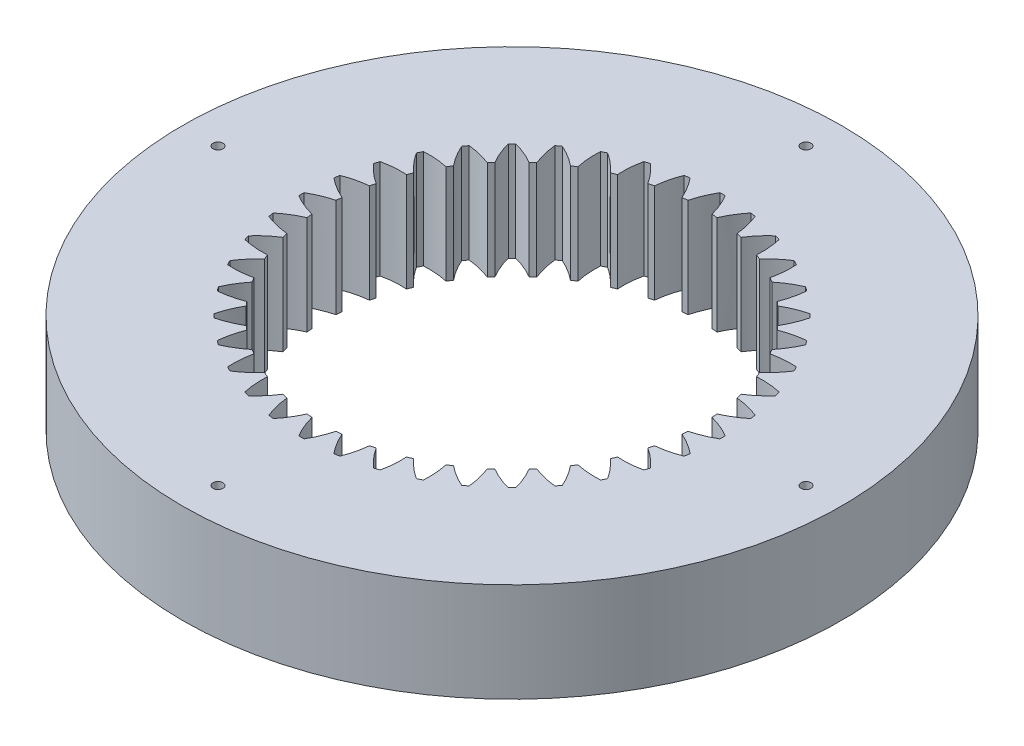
from build123d import *

# Parameters (mm, degrees)
SKETCH1_R           = 99.75
BOSS_EXTRUDE1_DEPTH = 30
SKETCH3_R           = 1.5
CUT_EXTRUDE1_DEPTH  = 145.222484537


with BuildPart() as part:
    # Sketch1 → Boss-Extrude1 (new body)
    with BuildSketch(Plane(origin=(0, 0, 0), x_dir=(1, 0, 0), z_dir=(0, 1, 0))):
        with Locations(Location((0, 0, 0), (0, 0, 270))):
            Circle(SKETCH1_R)
        with BuildLine():
            ThreePointArc((-3.646318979, 56.883251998), (-4.472168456, 56.824288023), (-5.297074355, 56.753334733))
            add(Edge.make_bspline(
                [(-5.297074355, 56.753334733), (-6.819032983, 60.229344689), (-9.181551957, 63.086362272)],
                knots=[0, 0, 0, 0.831880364, 0.831880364, 0.831880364], degree=2))
            ThreePointArc((-9.181551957, 63.086362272), (-9.972853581, 62.966119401), (-10.762583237, 62.835951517))
            add(Edge.make_bspline(
                [(-12.499927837, 55.612514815), (-12.126605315, 59.388707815), (-10.762583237, 62.835951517)],
                knots=[0, 0, 0, 0.831880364, 0.831880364, 0.831880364], degree=2))
            ThreePointArc((-12.499927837, 55.612514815), (-13.30638574, 55.425085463), (-14.110036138, 55.225962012))
            add(Edge.make_bspline(
                [(-14.110036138, 55.225962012), (-16.157024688, 58.421089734), (-18.93739315, 60.873353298)],
                knots=[0, 0, 0, 0.831880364, 0.831880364, 0.831880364], degree=2))
            ThreePointArc((-18.93739315, 60.873353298), (-19.700142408, 60.63080397), (-20.459786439, 60.378697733))
            add(Edge.make_bspline(
                [(-21.045746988, 52.97241295), (-21.267747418, 56.760515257), (-20.459786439, 60.378697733)],
                knots=[0, 0, 0, 0.831880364, 0.831880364, 0.831880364], degree=2))
            ThreePointArc((-21.045746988, 52.97241295), (-21.812955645, 52.661133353), (-22.575562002, 52.338742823))
            add(Edge.make_bspline(
                [(-22.575562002, 52.338742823), (-25.097176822, 55.174313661), (-28.226932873, 57.161440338)],
                knots=[0, 0, 0, 0.831880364, 0.831880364, 0.831880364], degree=2))
            ThreePointArc((-28.226932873, 57.161440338), (-28.942348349, 56.802556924), (-29.653201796, 56.434720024))
            add(Edge.make_bspline(
                [(-29.073350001, 49.027954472), (-29.885206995, 52.734690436), (-29.653201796, 56.434720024)],
                knots=[0, 0, 0, 0.831880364, 0.831880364, 0.831880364], degree=2))
            ThreePointArc((-29.073350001, 49.027954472), (-29.782418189, 48.600489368), (-30.485202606, 48.162770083))
            add(Edge.make_bspline(
                [(-30.485202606, 48.162770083), (-33.419353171, 50.568962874), (-36.82143183, 52.04202301)],
                knots=[0, 0, 0, 0.831880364, 0.831880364, 0.831880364], degree=2))
            ThreePointArc((-36.82143183, 52.04202301), (-37.471897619, 51.575642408), (-38.116456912, 51.101132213))
            add(Edge.make_bspline(
                [(-36.385070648, 43.876265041), (-37.766793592, 47.410362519), (-38.116456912, 51.101132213)],
                knots=[0, 0, 0, 0.831880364, 0.831880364, 0.831880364], degree=2))
            ThreePointArc((-36.385070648, 43.876265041), (-37.018538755, 43.343140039), (-37.644196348, 42.8008701))
            add(Edge.make_bspline(
                [(-37.644196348, 42.8008701), (-40.918634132, 44.718436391), (-44.509264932, 45.641158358)],
                knots=[0, 0, 0, 0.831880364, 0.831880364, 0.831880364], degree=2))
            ThreePointArc((-44.509264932, 45.641158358), (-45.078764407, 45.078764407), (-45.641158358, 44.509264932))
            add(Edge.make_bspline(
                [(-42.8008701, 37.644196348), (-44.718436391, 40.918634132), (-45.641158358, 44.509264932)],
                knots=[0, 0, 0, 0.831880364, 0.831880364, 0.831880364], degree=2))
            ThreePointArc((-42.8008701, 37.644196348), (-43.343140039, 37.018538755), (-43.876265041, 36.385070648))
            add(Edge.make_bspline(
                [(-43.876265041, 36.385070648), (-47.410362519, 37.766793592), (-51.101132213, 38.116456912)],
                knots=[0, 0, 0, 0.831880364, 0.831880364, 0.831880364], degree=2))
            ThreePointArc((-51.101132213, 38.116456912), (-51.575642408, 37.471897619), (-52.04202301, 36.82143183))
            add(Edge.make_bspline(
                [(-48.162770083, 30.485202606), (-50.568962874, 33.419353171), (-52.04202301, 36.82143183)],
                knots=[0, 0, 0, 0.831880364, 0.831880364, 0.831880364], degree=2))
            ThreePointArc((-48.162770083, 30.485202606), (-48.600489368, 29.782418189), (-49.027954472, 29.073350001))
            add(Edge.make_bspline(
                [(-49.027954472, 29.073350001), (-52.734690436, 29.885206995), (-56.434720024, 29.653201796)],
                knots=[0, 0, 0, 0.831880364, 0.831880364, 0.831880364], degree=2))
            ThreePointArc((-56.434720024, 29.653201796), (-56.802556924, 28.942348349), (-57.161440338, 28.226932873))
            add(Edge.make_bspline(
                [(-52.338742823, 22.575562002), (-55.174313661, 25.097176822), (-57.161440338, 28.226932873)],
                knots=[0, 0, 0, 0.831880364, 0.831880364, 0.831880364], degree=2))
            ThreePointArc((-52.338742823, 22.575562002), (-52.661133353, 21.812955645), (-52.97241295, 21.045746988))
            add(Edge.make_bspline(
                [(-52.97241295, 21.045746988), (-56.760515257, 21.267747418), (-60.378697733, 20.459786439)],
                knots=[0, 0, 0, 0.831880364, 0.831880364, 0.831880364], degree=2))
            ThreePointArc((-60.378697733, 20.459786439), (-60.63080397, 19.700142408), (-60.873353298, 18.93739315))
            add(Edge.make_bspline(
                [(-55.225962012, 14.110036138), (-58.421089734, 16.157024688), (-60.873353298, 18.93739315)],
                knots=[0, 0, 0, 0.831880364, 0.831880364, 0.831880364], degree=2))
            ThreePointArc((-55.225962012, 14.110036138), (-55.425085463, 13.30638574), (-55.612514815, 12.499927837))
            add(Edge.make_bspline(
                [(-55.612514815, 12.499927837), (-59.388707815, 12.126605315), (-62.835951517, 10.762583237)],
                knots=[0, 0, 0, 0.831880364, 0.831880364, 0.831880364], degree=2))
            ThreePointArc((-62.835951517, 10.762583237), (-62.966119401, 9.972853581), (-63.086362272, 9.181551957))
            add(Edge.make_bspline(
                [(-56.753334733, 5.297074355), (-60.229344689, 6.819032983), (-63.086362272, 9.181551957)],
                knots=[0, 0, 0, 0.831880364, 0.831880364, 0.831880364], degree=2))
            ThreePointArc((-56.753334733, 5.297074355), (-56.824288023, 4.472168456), (-56.883251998, 3.646318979))
            add(Edge.make_bspline(
                [(-56.883251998, 3.646318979), (-60.554553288, 2.686865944), (-63.745975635, 0.800369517)],
                knots=[0, 0, 0, 0.831880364, 0.831880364, 0.831880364], degree=2))
            ThreePointArc((-63.745975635, 0.800369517), (-63.751, 0), (-63.745975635, -0.800369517))
            add(Edge.make_bspline(
                [(-56.883251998, -3.646318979), (-60.554553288, -2.686865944), (-63.745975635, -0.800369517)],
                knots=[0, 0, 0, 0.831880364, 0.831880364, 0.831880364], degree=2))
            ThreePointArc((-56.883251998, -3.646318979), (-56.824288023, -4.472168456), (-56.753334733, -5.297074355))
            add(Edge.make_bspline(
                [(-56.753334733, -5.297074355), (-60.229344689, -6.819032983), (-63.086362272, -9.181551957)],
                knots=[0, 0, 0, 0.831880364, 0.831880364, 0.831880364], degree=2))
            ThreePointArc((-63.086362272, -9.181551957), (-62.966119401, -9.972853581), (-62.835951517, -10.762583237))
            add(Edge.make_bspline(
                [(-55.612514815, -12.499927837), (-59.388707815, -12.126605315), (-62.835951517, -10.762583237)],
                knots=[0, 0, 0, 0.831880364, 0.831880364, 0.831880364], degree=2))
            ThreePointArc((-55.612514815, -12.499927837), (-55.425085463, -13.30638574), (-55.225962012, -14.110036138))
            add(Edge.make_bspline(
                [(-55.225962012, -14.110036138), (-58.421089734, -16.157024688), (-60.873353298, -18.93739315)],
                knots=[0, 0, 0, 0.831880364, 0.831880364, 0.831880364], degree=2))
            ThreePointArc((-60.873353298, -18.93739315), (-60.63080397, -19.700142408), (-60.378697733, -20.459786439))
            add(Edge.make_bspline(
                [(-52.97241295, -21.045746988), (-56.760515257, -21.267747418), (-60.378697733, -20.459786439)],
                knots=[0, 0, 0, 0.831880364, 0.831880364, 0.831880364], degree=2))
            ThreePointArc((-52.97241295, -21.045746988), (-52.661133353, -21.812955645), (-52.338742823, -22.575562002))
            add(Edge.make_bspline(
                [(-52.338742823, -22.575562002), (-55.174313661, -25.097176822), (-57.161440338, -28.226932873)],
                knots=[0, 0, 0, 0.831880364, 0.831880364, 0.831880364], degree=2))
            ThreePointArc((-57.161440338, -28.226932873), (-56.802556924, -28.942348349), (-56.434720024, -29.653201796))
            add(Edge.make_bspline(
                [(-49.027954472, -29.073350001), (-52.734690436, -29.885206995), (-56.434720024, -29.653201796)],
                knots=[0, 0, 0, 0.831880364, 0.831880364, 0.831880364], degree=2))
            ThreePointArc((-49.027954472, -29.073350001), (-48.600489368, -29.782418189), (-48.162770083, -30.485202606))
            add(Edge.make_bspline(
                [(-48.162770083, -30.485202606), (-50.568962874, -33.419353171), (-52.04202301, -36.82143183)],
                knots=[0, 0, 0, 0.831880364, 0.831880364, 0.831880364], degree=2))
            ThreePointArc((-52.04202301, -36.82143183), (-51.575642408, -37.471897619), (-51.101132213, -38.116456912))
            add(Edge.make_bspline(
                [(-43.876265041, -36.385070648), (-47.410362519, -37.766793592), (-51.101132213, -38.116456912)],
                knots=[0, 0, 0, 0.831880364, 0.831880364, 0.831880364], degree=2))
            ThreePointArc((-43.876265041, -36.385070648), (-43.343140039, -37.018538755), (-42.8008701, -37.644196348))
            add(Edge.make_bspline(
                [(-42.8008701, -37.644196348), (-44.718436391, -40.918634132), (-45.641158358, -44.509264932)],
                knots=[0, 0, 0, 0.831880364, 0.831880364, 0.831880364], degree=2))
            ThreePointArc((-45.641158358, -44.509264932), (-45.078764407, -45.078764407), (-44.509264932, -45.641158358))
            add(Edge.make_bspline(
                [(-37.644196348, -42.8008701), (-40.918634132, -44.718436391), (-44.509264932, -45.641158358)],
                knots=[0, 0, 0, 0.831880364, 0.831880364, 0.831880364], degree=2))
            ThreePointArc((-37.644196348, -42.8008701), (-37.018538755, -43.343140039), (-36.385070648, -43.876265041))
            add(Edge.make_bspline(
                [(-36.385070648, -43.876265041), (-37.766793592, -47.410362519), (-38.116456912, -51.101132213)],
                knots=[0, 0, 0, 0.831880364, 0.831880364, 0.831880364], degree=2))
            ThreePointArc((-38.116456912, -51.101132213), (-37.471897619, -51.575642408), (-36.82143183, -52.04202301))
            add(Edge.make_bspline(
                [(-30.485202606, -48.162770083), (-33.419353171, -50.568962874), (-36.82143183, -52.04202301)],
                knots=[0, 0, 0, 0.831880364, 0.831880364, 0.831880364], degree=2))
            ThreePointArc((-30.485202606, -48.162770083), (-29.782418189, -48.600489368), (-29.073350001, -49.027954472))
            add(Edge.make_bspline(
                [(-29.073350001, -49.027954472), (-29.885206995, -52.734690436), (-29.653201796, -56.434720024)],
                knots=[0, 0, 0, 0.831880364, 0.831880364, 0.831880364], degree=2))
            ThreePointArc((-29.653201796, -56.434720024), (-28.942348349, -56.802556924), (-28.226932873, -57.161440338))
            add(Edge.make_bspline(
                [(-22.575562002, -52.338742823), (-25.097176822, -55.174313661), (-28.226932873, -57.161440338)],
                knots=[0, 0, 0, 0.831880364, 0.831880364, 0.831880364], degree=2))
            ThreePointArc((-22.575562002, -52.338742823), (-21.812955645, -52.661133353), (-21.045746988, -52.97241295))
            add(Edge.make_bspline(
                [(-21.045746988, -52.97241295), (-21.267747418, -56.760515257), (-20.459786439, -60.378697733)],
                knots=[0, 0, 0, 0.831880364, 0.831880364, 0.831880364], degree=2))
            ThreePointArc((-20.459786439, -60.378697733), (-19.700142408, -60.63080397), (-18.93739315, -60.873353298))
            add(Edge.make_bspline(
                [(-14.110036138, -55.225962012), (-16.157024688, -58.421089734), (-18.93739315, -60.873353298)],
                knots=[0, 0, 0, 0.831880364, 0.831880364, 0.831880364], degree=2))
            ThreePointArc((-14.110036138, -55.225962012), (-13.30638574, -55.425085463), (-12.499927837, -55.612514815))
            add(Edge.make_bspline(
                [(-12.499927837, -55.612514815), (-12.126605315, -59.388707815), (-10.762583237, -62.835951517)],
                knots=[0, 0, 0, 0.831880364, 0.831880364, 0.831880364], degree=2))
            ThreePointArc((-10.762583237, -62.835951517), (-9.972853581, -62.966119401), (-9.181551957, -63.086362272))
            add(Edge.make_bspline(
                [(-5.297074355, -56.753334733), (-6.819032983, -60.229344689), (-9.181551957, -63.086362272)],
                knots=[0, 0, 0, 0.831880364, 0.831880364, 0.831880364], degree=2))
            ThreePointArc((-5.297074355, -56.753334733), (-4.472168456, -56.824288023), (-3.646318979, -56.883251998))
            add(Edge.make_bspline(
                [(-3.646318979, -56.883251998), (-2.686865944, -60.554553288), (-0.800369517, -63.745975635)],
                knots=[0, 0, 0, 0.831880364, 0.831880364, 0.831880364], degree=2))
            ThreePointArc((-0.800369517, -63.745975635), (0, -63.751), (0.800369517, -63.745975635))
            add(Edge.make_bspline(
                [(3.646318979, -56.883251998), (2.686865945, -60.554553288), (0.800369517, -63.745975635)],
                knots=[0, 0, 0, 0.831880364, 0.831880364, 0.831880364], degree=2))
            ThreePointArc((3.646318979, -56.883251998), (4.472168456, -56.824288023), (5.297074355, -56.753334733))
            add(Edge.make_bspline(
                [(5.297074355, -56.753334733), (6.819032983, -60.229344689), (9.181551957, -63.086362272)],
                knots=[0, 0, 0, 0.831880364, 0.831880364, 0.831880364], degree=2))
            ThreePointArc((9.181551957, -63.086362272), (9.972853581, -62.966119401), (10.762583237, -62.835951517))
            add(Edge.make_bspline(
                [(12.499927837, -55.612514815), (12.126605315, -59.388707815), (10.762583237, -62.835951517)],
                knots=[0, 0, 0, 0.831880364, 0.831880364, 0.831880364], degree=2))
            ThreePointArc((12.499927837, -55.612514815), (13.30638574, -55.425085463), (14.110036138, -55.225962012))
            add(Edge.make_bspline(
                [(14.110036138, -55.225962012), (16.157024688, -58.421089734), (18.93739315, -60.873353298)],
                knots=[0, 0, 0, 0.831880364, 0.831880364, 0.831880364], degree=2))
            ThreePointArc((18.93739315, -60.873353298), (19.700142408, -60.63080397), (20.459786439, -60.378697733))
            add(Edge.make_bspline(
                [(21.045746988, -52.97241295), (21.267747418, -56.760515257), (20.459786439, -60.378697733)],
                knots=[0, 0, 0, 0.831880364, 0.831880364, 0.831880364], degree=2))
            ThreePointArc((21.045746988, -52.97241295), (21.812955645, -52.661133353), (22.575562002, -52.338742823))
            add(Edge.make_bspline(
                [(22.575562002, -52.338742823), (25.097176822, -55.174313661), (28.226932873, -57.161440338)],
                knots=[0, 0, 0, 0.831880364, 0.831880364, 0.831880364], degree=2))
            ThreePointArc((28.226932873, -57.161440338), (28.942348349, -56.802556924), (29.653201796, -56.434720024))
            add(Edge.make_bspline(
                [(29.073350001, -49.027954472), (29.885206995, -52.734690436), (29.653201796, -56.434720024)],
                knots=[0, 0, 0, 0.831880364, 0.831880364, 0.831880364], degree=2))
            ThreePointArc((29.073350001, -49.027954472), (29.782418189, -48.600489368), (30.485202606, -48.162770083))
            add(Edge.make_bspline(
                [(30.485202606, -48.162770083), (33.419353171, -50.568962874), (36.82143183, -52.04202301)],
                knots=[0, 0, 0, 0.831880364, 0.831880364, 0.831880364], degree=2))
            ThreePointArc((36.82143183, -52.04202301), (37.471897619, -51.575642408), (38.116456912, -51.101132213))
            add(Edge.make_bspline(
                [(36.385070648, -43.876265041), (37.766793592, -47.410362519), (38.116456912, -51.101132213)],
                knots=[0, 0, 0, 0.831880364, 0.831880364, 0.831880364], degree=2))
            ThreePointArc((36.385070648, -43.876265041), (37.018538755, -43.343140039), (37.644196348, -42.8008701))
            add(Edge.make_bspline(
                [(37.644196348, -42.8008701), (40.918634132, -44.718436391), (44.509264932, -45.641158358)],
                knots=[0, 0, 0, 0.831880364, 0.831880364, 0.831880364], degree=2))
            ThreePointArc((44.509264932, -45.641158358), (45.078764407, -45.078764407), (45.641158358, -44.509264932))
            add(Edge.make_bspline(
                [(42.8008701, -37.644196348), (44.718436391, -40.918634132), (45.641158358, -44.509264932)],
                knots=[0, 0, 0, 0.831880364, 0.831880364, 0.831880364], degree=2))
            ThreePointArc((42.8008701, -37.644196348), (43.343140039, -37.018538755), (43.876265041, -36.385070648))
            add(Edge.make_bspline(
                [(43.876265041, -36.385070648), (47.410362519, -37.766793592), (51.101132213, -38.116456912)],
                knots=[0, 0, 0, 0.831880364, 0.831880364, 0.831880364], degree=2))
            ThreePointArc((51.101132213, -38.116456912), (51.575642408, -37.471897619), (52.04202301, -36.82143183))
            add(Edge.make_bspline(
                [(48.162770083, -30.485202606), (50.568962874, -33.419353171), (52.04202301, -36.82143183)],
                knots=[0, 0, 0, 0.831880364, 0.831880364, 0.831880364], degree=2))
            ThreePointArc((48.162770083, -30.485202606), (48.600489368, -29.782418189), (49.027954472, -29.073350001))
            add(Edge.make_bspline(
                [(49.027954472, -29.073350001), (52.734690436, -29.885206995), (56.434720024, -29.653201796)],
                knots=[0, 0, 0, 0.831880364, 0.831880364, 0.831880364], degree=2))
            ThreePointArc((56.434720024, -29.653201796), (56.802556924, -28.942348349), (57.161440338, -28.226932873))
            add(Edge.make_bspline(
                [(52.338742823, -22.575562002), (55.174313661, -25.097176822), (57.161440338, -28.226932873)],
                knots=[0, 0, 0, 0.831880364, 0.831880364, 0.831880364], degree=2))
            ThreePointArc((52.338742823, -22.575562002), (52.661133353, -21.812955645), (52.97241295, -21.045746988))
            add(Edge.make_bspline(
                [(52.97241295, -21.045746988), (56.760515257, -21.267747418), (60.378697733, -20.459786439)],
                knots=[0, 0, 0, 0.831880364, 0.831880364, 0.831880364], degree=2))
            ThreePointArc((60.378697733, -20.459786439), (60.63080397, -19.700142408), (60.873353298, -18.93739315))
            add(Edge.make_bspline(
                [(55.225962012, -14.110036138), (58.421089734, -16.157024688), (60.873353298, -18.93739315)],
                knots=[0, 0, 0, 0.831880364, 0.831880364, 0.831880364], degree=2))
            ThreePointArc((55.225962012, -14.110036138), (55.425085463, -13.30638574), (55.612514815, -12.499927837))
            add(Edge.make_bspline(
                [(55.612514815, -12.499927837), (59.388707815, -12.126605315), (62.835951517, -10.762583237)],
                knots=[0, 0, 0, 0.831880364, 0.831880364, 0.831880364], degree=2))
            ThreePointArc((62.835951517, -10.762583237), (62.966119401, -9.972853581), (63.086362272, -9.181551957))
            add(Edge.make_bspline(
                [(56.753334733, -5.297074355), (60.229344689, -6.819032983), (63.086362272, -9.181551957)],
                knots=[0, 0, 0, 0.831880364, 0.831880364, 0.831880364], degree=2))
            ThreePointArc((56.753334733, -5.297074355), (56.824288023, -4.472168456), (56.883251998, -3.646318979))
            add(Edge.make_bspline(
                [(56.883251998, -3.646318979), (60.554553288, -2.686865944), (63.745975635, -0.800369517)],
                knots=[0, 0, 0, 0.831880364, 0.831880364, 0.831880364], degree=2))
            ThreePointArc((63.745975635, -0.800369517), (63.751, 0), (63.745975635, 0.800369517))
            add(Edge.make_bspline(
                [(56.883251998, 3.646318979), (60.554553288, 2.686865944), (63.745975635, 0.800369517)],
                knots=[0, 0, 0, 0.831880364, 0.831880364, 0.831880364], degree=2))
            ThreePointArc((56.883251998, 3.646318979), (56.824288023, 4.472168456), (56.753334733, 5.297074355))
            add(Edge.make_bspline(
                [(56.753334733, 5.297074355), (60.229344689, 6.819032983), (63.086362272, 9.181551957)],
                knots=[0, 0, 0, 0.831880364, 0.831880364, 0.831880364], degree=2))
            ThreePointArc((63.086362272, 9.181551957), (62.966119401, 9.972853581), (62.835951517, 10.762583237))
            add(Edge.make_bspline(
                [(55.612514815, 12.499927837), (59.388707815, 12.126605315), (62.835951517, 10.762583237)],
                knots=[0, 0, 0, 0.831880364, 0.831880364, 0.831880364], degree=2))
            ThreePointArc((55.612514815, 12.499927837), (55.425085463, 13.30638574), (55.225962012, 14.110036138))
            add(Edge.make_bspline(
                [(55.225962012, 14.110036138), (58.421089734, 16.157024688), (60.873353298, 18.93739315)],
                knots=[0, 0, 0, 0.831880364, 0.831880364, 0.831880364], degree=2))
            ThreePointArc((60.873353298, 18.93739315), (60.63080397, 19.700142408), (60.378697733, 20.459786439))
            add(Edge.make_bspline(
                [(52.97241295, 21.045746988), (56.760515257, 21.267747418), (60.378697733, 20.459786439)],
                knots=[0, 0, 0, 0.831880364, 0.831880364, 0.831880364], degree=2))
            ThreePointArc((52.97241295, 21.045746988), (52.661133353, 21.812955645), (52.338742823, 22.575562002))
            add(Edge.make_bspline(
                [(52.338742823, 22.575562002), (55.174313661, 25.097176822), (57.161440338, 28.226932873)],
                knots=[0, 0, 0, 0.831880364, 0.831880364, 0.831880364], degree=2))
            ThreePointArc((57.161440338, 28.226932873), (56.802556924, 28.942348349), (56.434720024, 29.653201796))
            add(Edge.make_bspline(
                [(49.027954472, 29.073350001), (52.734690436, 29.885206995), (56.434720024, 29.653201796)],
                knots=[0, 0, 0, 0.831880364, 0.831880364, 0.831880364], degree=2))
            ThreePointArc((49.027954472, 29.073350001), (48.600489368, 29.782418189), (48.162770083, 30.485202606))
            add(Edge.make_bspline(
                [(48.162770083, 30.485202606), (50.568962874, 33.419353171), (52.04202301, 36.82143183)],
                knots=[0, 0, 0, 0.831880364, 0.831880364, 0.831880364], degree=2))
            ThreePointArc((52.04202301, 36.82143183), (51.575642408, 37.471897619), (51.101132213, 38.116456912))
            add(Edge.make_bspline(
                [(43.876265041, 36.385070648), (47.410362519, 37.766793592), (51.101132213, 38.116456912)],
                knots=[0, 0, 0, 0.831880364, 0.831880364, 0.831880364], degree=2))
            ThreePointArc((43.876265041, 36.385070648), (43.343140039, 37.018538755), (42.8008701, 37.644196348))
            add(Edge.make_bspline(
                [(42.8008701, 37.644196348), (44.718436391, 40.918634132), (45.641158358, 44.509264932)],
                knots=[0, 0, 0, 0.831880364, 0.831880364, 0.831880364], degree=2))
            ThreePointArc((45.641158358, 44.509264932), (45.078764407, 45.078764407), (44.509264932, 45.641158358))
            add(Edge.make_bspline(
                [(37.644196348, 42.8008701), (40.918634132, 44.718436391), (44.509264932, 45.641158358)],
                knots=[0, 0, 0, 0.831880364, 0.831880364, 0.831880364], degree=2))
            ThreePointArc((37.644196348, 42.8008701), (37.018538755, 43.343140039), (36.385070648, 43.876265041))
            add(Edge.make_bspline(
                [(36.385070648, 43.876265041), (37.766793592, 47.410362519), (38.116456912, 51.101132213)],
                knots=[0, 0, 0, 0.831880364, 0.831880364, 0.831880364], degree=2))
            ThreePointArc((38.116456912, 51.101132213), (37.471897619, 51.575642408), (36.82143183, 52.04202301))
            add(Edge.make_bspline(
                [(30.485202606, 48.162770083), (33.419353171, 50.568962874), (36.82143183, 52.04202301)],
                knots=[0, 0, 0, 0.831880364, 0.831880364, 0.831880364], degree=2))
            ThreePointArc((30.485202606, 48.162770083), (29.782418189, 48.600489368), (29.073350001, 49.027954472))
            add(Edge.make_bspline(
                [(29.073350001, 49.027954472), (29.885206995, 52.734690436), (29.653201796, 56.434720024)],
                knots=[0, 0, 0, 0.831880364, 0.831880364, 0.831880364], degree=2))
            ThreePointArc((29.653201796, 56.434720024), (28.942348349, 56.802556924), (28.226932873, 57.161440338))
            add(Edge.make_bspline(
                [(22.575562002, 52.338742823), (25.097176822, 55.174313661), (28.226932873, 57.161440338)],
                knots=[0, 0, 0, 0.831880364, 0.831880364, 0.831880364], degree=2))
            ThreePointArc((22.575562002, 52.338742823), (21.812955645, 52.661133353), (21.045746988, 52.97241295))
            add(Edge.make_bspline(
                [(21.045746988, 52.97241295), (21.267747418, 56.760515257), (20.459786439, 60.378697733)],
                knots=[0, 0, 0, 0.831880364, 0.831880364, 0.831880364], degree=2))
            ThreePointArc((20.459786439, 60.378697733), (19.700142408, 60.63080397), (18.93739315, 60.873353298))
            add(Edge.make_bspline(
                [(14.110036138, 55.225962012), (16.157024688, 58.421089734), (18.93739315, 60.873353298)],
                knots=[0, 0, 0, 0.831880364, 0.831880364, 0.831880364], degree=2))
            ThreePointArc((14.110036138, 55.225962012), (13.30638574, 55.425085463), (12.499927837, 55.612514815))
            add(Edge.make_bspline(
                [(12.499927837, 55.612514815), (12.126605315, 59.388707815), (10.762583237, 62.835951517)],
                knots=[0, 0, 0, 0.831880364, 0.831880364, 0.831880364], degree=2))
            ThreePointArc((10.762583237, 62.835951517), (9.972853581, 62.966119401), (9.181551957, 63.086362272))
            add(Edge.make_bspline(
                [(5.297074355, 56.753334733), (6.819032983, 60.229344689), (9.181551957, 63.086362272)],
                knots=[0, 0, 0, 0.831880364, 0.831880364, 0.831880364], degree=2))
            ThreePointArc((5.297074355, 56.753334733), (4.472168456, 56.824288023), (3.646318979, 56.883251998))
            add(Edge.make_bspline(
                [(3.646318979, 56.883251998), (2.686865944, 60.554553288), (0.800369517, 63.745975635)],
                knots=[0, 0, 0, 0.831880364, 0.831880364, 0.831880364], degree=2))
            ThreePointArc((0.800369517, 63.745975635), (0, 63.751), (-0.800369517, 63.745975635))
            add(Edge.make_bspline(
                [(-3.646318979, 56.883251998), (-2.686865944, 60.554553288), (-0.800369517, 63.745975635)],
                knots=[0, 0, 0, 0.831880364, 0.831880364, 0.831880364], degree=2))
        make_face(mode=Mode.SUBTRACT)
    extrude(amount=BOSS_EXTRUDE1_DEPTH)

    # Sketch3 → Cut-Extrude1 (cut, through all)
    with BuildSketch(Plane(origin=(0, 30, 0), x_dir=(1, 0, 0), z_dir=(0, 1, 0))):
        with Locations(Location((0, 89, 0), (0, 0, 270))):
            Circle(SKETCH3_R)
        with Locations(Location((89, 0, 0), (0, 0, 270))):
            Circle(SKETCH3_R)
        with Locations(Location((0, -89, 0), (0, 0, 270))):
            Circle(SKETCH3_R)
        with Locations(Location((-89, 0, 0), (0, 0, 270))):
            Circle(SKETCH3_R)
    extrude(amount=-CUT_EXTRUDE1_DEPTH, mode=Mode.SUBTRACT)


solid = part.part
